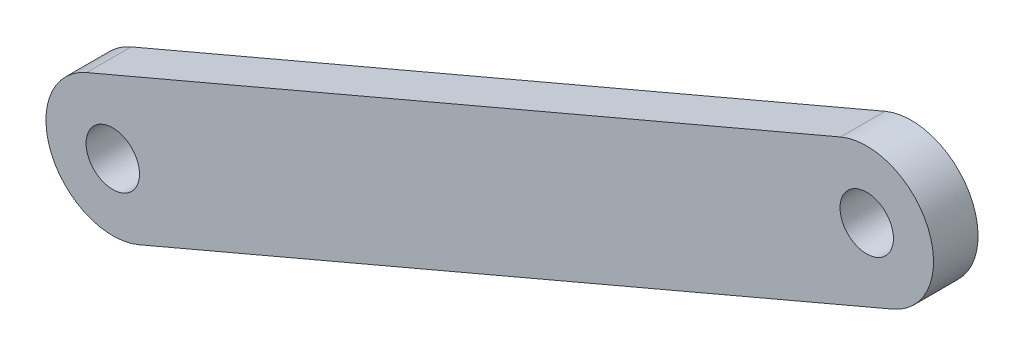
from build123d import *

# Parameters (mm, degrees)
BOSS_EXTRU_1_START      = -10
BOSS_EXTRU_1_DEPTH      = 5
ESQUISSE2_R             = 3
ENL_V_MAT_EXTRU_1_DEPTH = 5


with BuildPart() as part:
    # Esquisse1 → Boss.-Extru.1 (new body)
    with BuildSketch(Plane.XY.offset(BOSS_EXTRU_1_START)):
        with BuildLine():
            Line((2.939493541, -26.899954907), (-81.699953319, -62.957742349))
            ThreePointArc((-81.699953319, -62.957742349), (-91.539401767, -58.997280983), (-87.578940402, -49.157832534))
            Line((-87.578940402, -49.157832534), (-2.939493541, -13.100045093))
            ThreePointArc((-2.939493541, -13.100045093), (6.899954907, -17.060506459), (2.939493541, -26.899954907))
        make_face()
    extrude(amount=BOSS_EXTRU_1_DEPTH)

    # Esquisse2 → Enl_v. mat.-Extru.1 (cut)
    with BuildSketch(Plane.XY.offset(-5)):
        with Locations((0, -20)):
            Circle(ESQUISSE2_R)
        with Locations((-84.63944686, -56.057787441)):
            Circle(ESQUISSE2_R)
    extrude(amount=-ENL_V_MAT_EXTRU_1_DEPTH, mode=Mode.SUBTRACT)


solid = part.part
